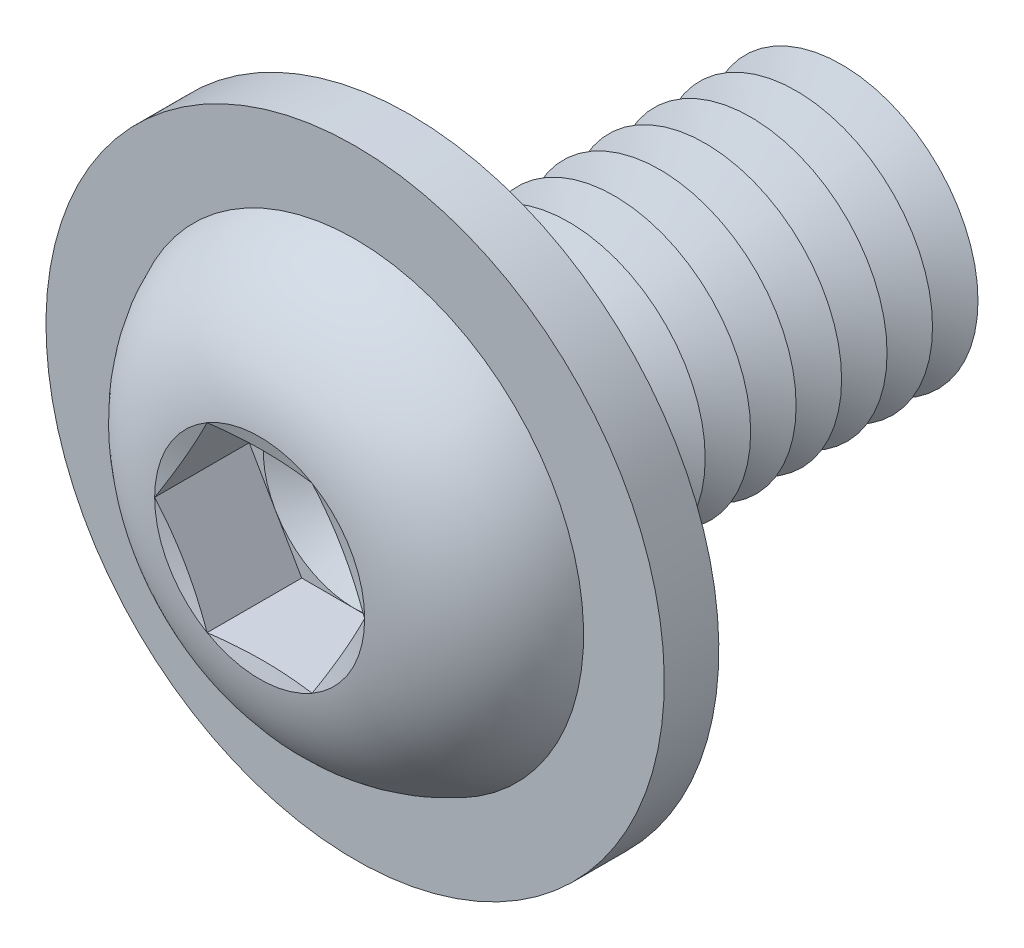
ISO-10303-21;
HEADER;
FILE_DESCRIPTION(('STEP AP214'),'2;1');
FILE_NAME('part.step','',(''),(''),'','','');
FILE_SCHEMA(('AUTOMOTIVE_DESIGN { 1 0 10303 214 1 1 1 1 }'));
ENDSEC;
DATA;
#1=APPLICATION_CONTEXT('core data for automotive mechanical design processes');
#2=APPLICATION_PROTOCOL_DEFINITION('international standard','automotive_design',2000,#1);
#3=PRODUCT_CONTEXT('',#1,'mechanical');
#4=PRODUCT('Part','Part','',(#3));
#5=PRODUCT_RELATED_PRODUCT_CATEGORY('part','',(#4));
#6=PRODUCT_DEFINITION_FORMATION('','',#4);
#7=PRODUCT_DEFINITION_CONTEXT('part definition',#1,'design');
#8=PRODUCT_DEFINITION('design','',#6,#7);
#9=PRODUCT_DEFINITION_SHAPE('','',#8);
#10=(LENGTH_UNIT() NAMED_UNIT(*) SI_UNIT(.MILLI.,.METRE.));
#11=(NAMED_UNIT(*) PLANE_ANGLE_UNIT() SI_UNIT($,.RADIAN.));
#12=(NAMED_UNIT(*) SI_UNIT($,.STERADIAN.) SOLID_ANGLE_UNIT());
#13=UNCERTAINTY_MEASURE_WITH_UNIT(LENGTH_MEASURE(1.E-05),#10,'distance_accuracy_value','');
#14=(GEOMETRIC_REPRESENTATION_CONTEXT(3) GLOBAL_UNCERTAINTY_ASSIGNED_CONTEXT((#13)) GLOBAL_UNIT_ASSIGNED_CONTEXT((#10,
#11,#12)) REPRESENTATION_CONTEXT('',''));
#15=CARTESIAN_POINT('',(0.,0.,0.));
#16=DIRECTION('',(0.,0.,1.));
#17=DIRECTION('',(1.,0.,0.));
#18=AXIS2_PLACEMENT_3D('',#15,#16,#17);
#19=CARTESIAN_POINT('',(0.,0.,-6.5));
#20=DIRECTION('',(0.,0.,1.));
#21=DIRECTION('',(1.,0.,0.));
#22=AXIS2_PLACEMENT_3D('',#19,#20,#21);
#23=CONICAL_SURFACE('',#22,3.,1.0471975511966);
#24=CARTESIAN_POINT('',(0.,0.,-7.));
#25=DIRECTION('',(0.,0.,1.));
#26=DIRECTION('',(1.,0.,0.));
#27=AXIS2_PLACEMENT_3D('',#24,#25,#26);
#28=CIRCLE('',#27,2.13397459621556);
#29=CARTESIAN_POINT('',(2.13397459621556,0.,-7.));
#30=VERTEX_POINT('',#29);
#31=EDGE_CURVE('E290',#30,#30,#28,.T.);
#32=ORIENTED_EDGE('',*,*,#31,.T.);
#33=EDGE_LOOP('',(#32));
#34=FACE_BOUND('',#33,.T.);
#35=CARTESIAN_POINT('',(0.,0.,-6.5));
#36=DIRECTION('',(0.,0.,1.));
#37=DIRECTION('',(1.,0.,0.));
#38=AXIS2_PLACEMENT_3D('',#35,#36,#37);
#39=CIRCLE('',#38,3.);
#40=CARTESIAN_POINT('',(3.,0.,-6.5));
#41=VERTEX_POINT('',#40);
#42=EDGE_CURVE('E286',#41,#41,#39,.T.);
#43=ORIENTED_EDGE('',*,*,#42,.F.);
#44=EDGE_LOOP('',(#43));
#45=FACE_BOUND('',#44,.T.);
#46=ADVANCED_FACE('F39',(#34,#45),#23,.T.);
#47=CARTESIAN_POINT('',(0.,0.,-7.));
#48=DIRECTION('',(0.,0.,-1.));
#49=DIRECTION('',(-1.,0.,0.));
#50=AXIS2_PLACEMENT_3D('',#47,#48,#49);
#51=CONICAL_SURFACE('',#50,2.13397459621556,1.0471975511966);
#52=CARTESIAN_POINT('',(0.,0.,-7.5));
#53=DIRECTION('',(0.,0.,1.));
#54=DIRECTION('',(1.,0.,0.));
#55=AXIS2_PLACEMENT_3D('',#52,#53,#54);
#56=CIRCLE('',#55,3.);
#57=CARTESIAN_POINT('',(3.,0.,-7.5));
#58=VERTEX_POINT('',#57);
#59=EDGE_CURVE('E294',#58,#58,#56,.T.);
#60=ORIENTED_EDGE('',*,*,#59,.T.);
#61=EDGE_LOOP('',(#60));
#62=FACE_BOUND('',#61,.T.);
#63=ORIENTED_EDGE('',*,*,#31,.F.);
#64=EDGE_LOOP('',(#63));
#65=FACE_BOUND('',#64,.T.);
#66=ADVANCED_FACE('F410',(#62,#65),#51,.T.);
#67=CARTESIAN_POINT('',(0.,3.00000000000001,-10.));
#68=DIRECTION('',(0.,0.,-1.));
#69=DIRECTION('',(-1.,0.,0.));
#70=AXIS2_PLACEMENT_3D('',#67,#68,#69);
#71=PLANE('',#70);
#72=CARTESIAN_POINT('',(0.,0.,-10.));
#73=DIRECTION('',(0.,0.,1.));
#74=DIRECTION('',(1.,0.,0.));
#75=AXIS2_PLACEMENT_3D('',#72,#73,#74);
#76=CIRCLE('',#75,2.13397459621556);
#77=CARTESIAN_POINT('',(2.13397459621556,0.,-10.));
#78=VERTEX_POINT('',#77);
#79=EDGE_CURVE('E314',#78,#78,#76,.T.);
#80=ORIENTED_EDGE('',*,*,#79,.F.);
#81=EDGE_LOOP('',(#80));
#82=FACE_BOUND('',#81,.T.);
#83=ADVANCED_FACE('F416',(#82),#71,.T.);
#84=CARTESIAN_POINT('',(0.,0.,-9.5));
#85=DIRECTION('',(0.,0.,1.));
#86=DIRECTION('',(1.,0.,0.));
#87=AXIS2_PLACEMENT_3D('',#84,#85,#86);
#88=CONICAL_SURFACE('',#87,3.,1.0471975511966);
#89=ORIENTED_EDGE('',*,*,#79,.T.);
#90=EDGE_LOOP('',(#89));
#91=FACE_BOUND('',#90,.T.);
#92=CARTESIAN_POINT('',(0.,0.,-9.5));
#93=DIRECTION('',(0.,0.,1.));
#94=DIRECTION('',(1.,0.,0.));
#95=AXIS2_PLACEMENT_3D('',#92,#93,#94);
#96=CIRCLE('',#95,3.);
#97=CARTESIAN_POINT('',(3.,0.,-9.5));
#98=VERTEX_POINT('',#97);
#99=EDGE_CURVE('E310',#98,#98,#96,.T.);
#100=ORIENTED_EDGE('',*,*,#99,.F.);
#101=EDGE_LOOP('',(#100));
#102=FACE_BOUND('',#101,.T.);
#103=ADVANCED_FACE('F435',(#91,#102),#88,.T.);
#104=CARTESIAN_POINT('',(0.,0.,-9.));
#105=DIRECTION('',(0.,0.,-1.));
#106=DIRECTION('',(-1.,0.,0.));
#107=AXIS2_PLACEMENT_3D('',#104,#105,#106);
#108=CONICAL_SURFACE('',#107,2.13397459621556,1.0471975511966);
#109=ORIENTED_EDGE('',*,*,#99,.T.);
#110=EDGE_LOOP('',(#109));
#111=FACE_BOUND('',#110,.T.);
#112=CARTESIAN_POINT('',(0.,0.,-9.));
#113=DIRECTION('',(0.,0.,1.));
#114=DIRECTION('',(1.,0.,0.));
#115=AXIS2_PLACEMENT_3D('',#112,#113,#114);
#116=CIRCLE('',#115,2.13397459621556);
#117=CARTESIAN_POINT('',(2.13397459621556,0.,-9.));
#118=VERTEX_POINT('',#117);
#119=EDGE_CURVE('E306',#118,#118,#116,.T.);
#120=ORIENTED_EDGE('',*,*,#119,.F.);
#121=EDGE_LOOP('',(#120));
#122=FACE_BOUND('',#121,.T.);
#123=ADVANCED_FACE('F432',(#111,#122),#108,.T.);
#124=CARTESIAN_POINT('',(0.,0.,-8.5));
#125=DIRECTION('',(0.,0.,1.));
#126=DIRECTION('',(1.,0.,0.));
#127=AXIS2_PLACEMENT_3D('',#124,#125,#126);
#128=CONICAL_SURFACE('',#127,3.,1.0471975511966);
#129=ORIENTED_EDGE('',*,*,#119,.T.);
#130=EDGE_LOOP('',(#129));
#131=FACE_BOUND('',#130,.T.);
#132=CARTESIAN_POINT('',(0.,0.,-8.5));
#133=DIRECTION('',(0.,0.,1.));
#134=DIRECTION('',(1.,0.,0.));
#135=AXIS2_PLACEMENT_3D('',#132,#133,#134);
#136=CIRCLE('',#135,3.);
#137=CARTESIAN_POINT('',(3.,0.,-8.5));
#138=VERTEX_POINT('',#137);
#139=EDGE_CURVE('E302',#138,#138,#136,.T.);
#140=ORIENTED_EDGE('',*,*,#139,.F.);
#141=EDGE_LOOP('',(#140));
#142=FACE_BOUND('',#141,.T.);
#143=ADVANCED_FACE('F426',(#131,#142),#128,.T.);
#144=CARTESIAN_POINT('',(0.,0.,-8.));
#145=DIRECTION('',(0.,0.,-1.));
#146=DIRECTION('',(-1.,0.,0.));
#147=AXIS2_PLACEMENT_3D('',#144,#145,#146);
#148=CONICAL_SURFACE('',#147,2.13397459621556,1.0471975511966);
#149=ORIENTED_EDGE('',*,*,#139,.T.);
#150=EDGE_LOOP('',(#149));
#151=FACE_BOUND('',#150,.T.);
#152=CARTESIAN_POINT('',(0.,0.,-8.));
#153=DIRECTION('',(0.,0.,1.));
#154=DIRECTION('',(1.,0.,0.));
#155=AXIS2_PLACEMENT_3D('',#152,#153,#154);
#156=CIRCLE('',#155,2.13397459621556);
#157=CARTESIAN_POINT('',(2.13397459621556,0.,-8.));
#158=VERTEX_POINT('',#157);
#159=EDGE_CURVE('E298',#158,#158,#156,.T.);
#160=ORIENTED_EDGE('',*,*,#159,.F.);
#161=EDGE_LOOP('',(#160));
#162=FACE_BOUND('',#161,.T.);
#163=ADVANCED_FACE('F422',(#151,#162),#148,.T.);
#164=CARTESIAN_POINT('',(0.,0.,-7.5));
#165=DIRECTION('',(0.,0.,1.));
#166=DIRECTION('',(1.,0.,0.));
#167=AXIS2_PLACEMENT_3D('',#164,#165,#166);
#168=CONICAL_SURFACE('',#167,3.,1.0471975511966);
#169=ORIENTED_EDGE('',*,*,#159,.T.);
#170=EDGE_LOOP('',(#169));
#171=FACE_BOUND('',#170,.T.);
#172=ORIENTED_EDGE('',*,*,#59,.F.);
#173=EDGE_LOOP('',(#172));
#174=FACE_BOUND('',#173,.T.);
#175=ADVANCED_FACE('F425',(#171,#174),#168,.T.);
#176=CARTESIAN_POINT('',(0.,0.,-5.5));
#177=DIRECTION('',(0.,0.,1.));
#178=DIRECTION('',(1.,0.,0.));
#179=AXIS2_PLACEMENT_3D('',#176,#177,#178);
#180=CONICAL_SURFACE('',#179,3.,1.0471975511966);
#181=CARTESIAN_POINT('',(0.,0.,-6.));
#182=DIRECTION('',(0.,0.,1.));
#183=DIRECTION('',(1.,0.,0.));
#184=AXIS2_PLACEMENT_3D('',#181,#182,#183);
#185=CIRCLE('',#184,2.13397459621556);
#186=CARTESIAN_POINT('',(2.13397459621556,0.,-6.));
#187=VERTEX_POINT('',#186);
#188=EDGE_CURVE('E282',#187,#187,#185,.T.);
#189=ORIENTED_EDGE('',*,*,#188,.T.);
#190=EDGE_LOOP('',(#189));
#191=FACE_BOUND('',#190,.T.);
#192=CARTESIAN_POINT('',(0.,0.,-5.5));
#193=DIRECTION('',(0.,0.,1.));
#194=DIRECTION('',(1.,0.,0.));
#195=AXIS2_PLACEMENT_3D('',#192,#193,#194);
#196=CIRCLE('',#195,3.);
#197=CARTESIAN_POINT('',(3.,0.,-5.5));
#198=VERTEX_POINT('',#197);
#199=EDGE_CURVE('E278',#198,#198,#196,.T.);
#200=ORIENTED_EDGE('',*,*,#199,.F.);
#201=EDGE_LOOP('',(#200));
#202=FACE_BOUND('',#201,.T.);
#203=ADVANCED_FACE('F430',(#191,#202),#180,.T.);
#204=CARTESIAN_POINT('',(0.,0.,-6.));
#205=DIRECTION('',(0.,0.,-1.));
#206=DIRECTION('',(-1.,0.,0.));
#207=AXIS2_PLACEMENT_3D('',#204,#205,#206);
#208=CONICAL_SURFACE('',#207,2.13397459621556,1.0471975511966);
#209=ORIENTED_EDGE('',*,*,#42,.T.);
#210=EDGE_LOOP('',(#209));
#211=FACE_BOUND('',#210,.T.);
#212=ORIENTED_EDGE('',*,*,#188,.F.);
#213=EDGE_LOOP('',(#212));
#214=FACE_BOUND('',#213,.T.);
#215=ADVANCED_FACE('F481',(#211,#214),#208,.T.);
#216=CARTESIAN_POINT('',(0.,0.,-4.5));
#217=DIRECTION('',(0.,0.,1.));
#218=DIRECTION('',(1.,0.,0.));
#219=AXIS2_PLACEMENT_3D('',#216,#217,#218);
#220=CONICAL_SURFACE('',#219,3.,1.0471975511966);
#221=CARTESIAN_POINT('',(0.,0.,-5.));
#222=DIRECTION('',(0.,0.,1.));
#223=DIRECTION('',(1.,0.,0.));
#224=AXIS2_PLACEMENT_3D('',#221,#222,#223);
#225=CIRCLE('',#224,2.13397459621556);
#226=CARTESIAN_POINT('',(2.13397459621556,0.,-5.));
#227=VERTEX_POINT('',#226);
#228=EDGE_CURVE('E274',#227,#227,#225,.T.);
#229=ORIENTED_EDGE('',*,*,#228,.T.);
#230=EDGE_LOOP('',(#229));
#231=FACE_BOUND('',#230,.T.);
#232=CARTESIAN_POINT('',(0.,0.,-4.5));
#233=DIRECTION('',(0.,0.,1.));
#234=DIRECTION('',(1.,0.,0.));
#235=AXIS2_PLACEMENT_3D('',#232,#233,#234);
#236=CIRCLE('',#235,3.);
#237=CARTESIAN_POINT('',(3.,0.,-4.5));
#238=VERTEX_POINT('',#237);
#239=EDGE_CURVE('E270',#238,#238,#236,.T.);
#240=ORIENTED_EDGE('',*,*,#239,.F.);
#241=EDGE_LOOP('',(#240));
#242=FACE_BOUND('',#241,.T.);
#243=ADVANCED_FACE('F487',(#231,#242),#220,.T.);
#244=CARTESIAN_POINT('',(0.,0.,-5.));
#245=DIRECTION('',(0.,0.,-1.));
#246=DIRECTION('',(-1.,0.,0.));
#247=AXIS2_PLACEMENT_3D('',#244,#245,#246);
#248=CONICAL_SURFACE('',#247,2.13397459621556,1.0471975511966);
#249=ORIENTED_EDGE('',*,*,#199,.T.);
#250=EDGE_LOOP('',(#249));
#251=FACE_BOUND('',#250,.T.);
#252=ORIENTED_EDGE('',*,*,#228,.F.);
#253=EDGE_LOOP('',(#252));
#254=FACE_BOUND('',#253,.T.);
#255=ADVANCED_FACE('F494',(#251,#254),#248,.T.);
#256=CARTESIAN_POINT('',(0.,0.,-3.5));
#257=DIRECTION('',(0.,0.,1.));
#258=DIRECTION('',(1.,0.,0.));
#259=AXIS2_PLACEMENT_3D('',#256,#257,#258);
#260=CONICAL_SURFACE('',#259,3.,1.0471975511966);
#261=CARTESIAN_POINT('',(0.,0.,-4.));
#262=DIRECTION('',(0.,0.,1.));
#263=DIRECTION('',(1.,0.,0.));
#264=AXIS2_PLACEMENT_3D('',#261,#262,#263);
#265=CIRCLE('',#264,2.13397459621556);
#266=CARTESIAN_POINT('',(2.13397459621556,0.,-4.));
#267=VERTEX_POINT('',#266);
#268=EDGE_CURVE('E266',#267,#267,#265,.T.);
#269=ORIENTED_EDGE('',*,*,#268,.T.);
#270=EDGE_LOOP('',(#269));
#271=FACE_BOUND('',#270,.T.);
#272=CARTESIAN_POINT('',(0.,0.,-3.5));
#273=DIRECTION('',(0.,0.,1.));
#274=DIRECTION('',(1.,0.,0.));
#275=AXIS2_PLACEMENT_3D('',#272,#273,#274);
#276=CIRCLE('',#275,3.);
#277=CARTESIAN_POINT('',(3.,0.,-3.5));
#278=VERTEX_POINT('',#277);
#279=EDGE_CURVE('E262',#278,#278,#276,.T.);
#280=ORIENTED_EDGE('',*,*,#279,.F.);
#281=EDGE_LOOP('',(#280));
#282=FACE_BOUND('',#281,.T.);
#283=ADVANCED_FACE('F501',(#271,#282),#260,.T.);
#284=CARTESIAN_POINT('',(0.,0.,-4.));
#285=DIRECTION('',(0.,0.,-1.));
#286=DIRECTION('',(-1.,0.,0.));
#287=AXIS2_PLACEMENT_3D('',#284,#285,#286);
#288=CONICAL_SURFACE('',#287,2.13397459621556,1.0471975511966);
#289=ORIENTED_EDGE('',*,*,#239,.T.);
#290=EDGE_LOOP('',(#289));
#291=FACE_BOUND('',#290,.T.);
#292=ORIENTED_EDGE('',*,*,#268,.F.);
#293=EDGE_LOOP('',(#292));
#294=FACE_BOUND('',#293,.T.);
#295=ADVANCED_FACE('F508',(#291,#294),#288,.T.);
#296=CARTESIAN_POINT('',(0.,0.,-2.5));
#297=DIRECTION('',(0.,0.,1.));
#298=DIRECTION('',(1.,0.,0.));
#299=AXIS2_PLACEMENT_3D('',#296,#297,#298);
#300=CONICAL_SURFACE('',#299,3.,1.0471975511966);
#301=CARTESIAN_POINT('',(0.,0.,-3.));
#302=DIRECTION('',(0.,0.,1.));
#303=DIRECTION('',(1.,0.,0.));
#304=AXIS2_PLACEMENT_3D('',#301,#302,#303);
#305=CIRCLE('',#304,2.13397459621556);
#306=CARTESIAN_POINT('',(2.13397459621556,0.,-3.));
#307=VERTEX_POINT('',#306);
#308=EDGE_CURVE('E258',#307,#307,#305,.T.);
#309=ORIENTED_EDGE('',*,*,#308,.T.);
#310=EDGE_LOOP('',(#309));
#311=FACE_BOUND('',#310,.T.);
#312=CARTESIAN_POINT('',(0.,0.,-2.5));
#313=DIRECTION('',(0.,0.,1.));
#314=DIRECTION('',(1.,0.,0.));
#315=AXIS2_PLACEMENT_3D('',#312,#313,#314);
#316=CIRCLE('',#315,3.);
#317=CARTESIAN_POINT('',(3.,0.,-2.5));
#318=VERTEX_POINT('',#317);
#319=EDGE_CURVE('E254',#318,#318,#316,.T.);
#320=ORIENTED_EDGE('',*,*,#319,.F.);
#321=EDGE_LOOP('',(#320));
#322=FACE_BOUND('',#321,.T.);
#323=ADVANCED_FACE('F515',(#311,#322),#300,.T.);
#324=CARTESIAN_POINT('',(0.,0.,-3.));
#325=DIRECTION('',(0.,0.,-1.));
#326=DIRECTION('',(-1.,0.,0.));
#327=AXIS2_PLACEMENT_3D('',#324,#325,#326);
#328=CONICAL_SURFACE('',#327,2.13397459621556,1.0471975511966);
#329=ORIENTED_EDGE('',*,*,#279,.T.);
#330=EDGE_LOOP('',(#329));
#331=FACE_BOUND('',#330,.T.);
#332=ORIENTED_EDGE('',*,*,#308,.F.);
#333=EDGE_LOOP('',(#332));
#334=FACE_BOUND('',#333,.T.);
#335=ADVANCED_FACE('F522',(#331,#334),#328,.T.);
#336=CARTESIAN_POINT('',(0.,0.,-1.5));
#337=DIRECTION('',(0.,0.,1.));
#338=DIRECTION('',(1.,0.,0.));
#339=AXIS2_PLACEMENT_3D('',#336,#337,#338);
#340=CONICAL_SURFACE('',#339,3.,1.0471975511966);
#341=CARTESIAN_POINT('',(0.,0.,-2.));
#342=DIRECTION('',(0.,0.,1.));
#343=DIRECTION('',(1.,0.,0.));
#344=AXIS2_PLACEMENT_3D('',#341,#342,#343);
#345=CIRCLE('',#344,2.13397459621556);
#346=CARTESIAN_POINT('',(2.13397459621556,0.,-2.));
#347=VERTEX_POINT('',#346);
#348=EDGE_CURVE('E250',#347,#347,#345,.T.);
#349=ORIENTED_EDGE('',*,*,#348,.T.);
#350=EDGE_LOOP('',(#349));
#351=FACE_BOUND('',#350,.T.);
#352=CARTESIAN_POINT('',(0.,0.,-1.5));
#353=DIRECTION('',(0.,0.,1.));
#354=DIRECTION('',(1.,0.,0.));
#355=AXIS2_PLACEMENT_3D('',#352,#353,#354);
#356=CIRCLE('',#355,3.);
#357=CARTESIAN_POINT('',(3.,0.,-1.5));
#358=VERTEX_POINT('',#357);
#359=EDGE_CURVE('E242',#358,#358,#356,.T.);
#360=ORIENTED_EDGE('',*,*,#359,.F.);
#361=EDGE_LOOP('',(#360));
#362=FACE_BOUND('',#361,.T.);
#363=ADVANCED_FACE('F529',(#351,#362),#340,.T.);
#364=CARTESIAN_POINT('',(0.,0.,-2.));
#365=DIRECTION('',(0.,0.,-1.));
#366=DIRECTION('',(-1.,0.,0.));
#367=AXIS2_PLACEMENT_3D('',#364,#365,#366);
#368=CONICAL_SURFACE('',#367,2.13397459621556,1.0471975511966);
#369=ORIENTED_EDGE('',*,*,#319,.T.);
#370=EDGE_LOOP('',(#369));
#371=FACE_BOUND('',#370,.T.);
#372=ORIENTED_EDGE('',*,*,#348,.F.);
#373=EDGE_LOOP('',(#372));
#374=FACE_BOUND('',#373,.T.);
#375=ADVANCED_FACE('F536',(#371,#374),#368,.T.);
#376=CARTESIAN_POINT('',(0.,0.,-0.499999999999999));
#377=DIRECTION('',(0.,0.,1.));
#378=DIRECTION('',(1.,0.,0.));
#379=AXIS2_PLACEMENT_3D('',#376,#377,#378);
#380=CONICAL_SURFACE('',#379,3.,1.0471975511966);
#381=CARTESIAN_POINT('',(0.,0.,-0.999999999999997));
#382=DIRECTION('',(0.,0.,1.));
#383=DIRECTION('',(1.,0.,0.));
#384=AXIS2_PLACEMENT_3D('',#381,#382,#383);
#385=CIRCLE('',#384,2.13397459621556);
#386=CARTESIAN_POINT('',(2.13397459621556,0.,-0.999999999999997));
#387=VERTEX_POINT('',#386);
#388=EDGE_CURVE('E231',#387,#387,#385,.T.);
#389=ORIENTED_EDGE('',*,*,#388,.T.);
#390=EDGE_LOOP('',(#389));
#391=FACE_BOUND('',#390,.T.);
#392=CARTESIAN_POINT('',(0.,0.,-0.499999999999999));
#393=DIRECTION('',(0.,0.,1.));
#394=DIRECTION('',(1.,0.,0.));
#395=AXIS2_PLACEMENT_3D('',#392,#393,#394);
#396=CIRCLE('',#395,3.);
#397=CARTESIAN_POINT('',(3.,0.,-0.499999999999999));
#398=VERTEX_POINT('',#397);
#399=EDGE_CURVE('E246',#398,#398,#396,.T.);
#400=ORIENTED_EDGE('',*,*,#399,.F.);
#401=EDGE_LOOP('',(#400));
#402=FACE_BOUND('',#401,.T.);
#403=ADVANCED_FACE('F543',(#391,#402),#380,.T.);
#404=CARTESIAN_POINT('',(0.,0.,-0.999999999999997));
#405=DIRECTION('',(0.,0.,-1.));
#406=DIRECTION('',(-1.,0.,0.));
#407=AXIS2_PLACEMENT_3D('',#404,#405,#406);
#408=CONICAL_SURFACE('',#407,2.13397459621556,1.0471975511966);
#409=ORIENTED_EDGE('',*,*,#359,.T.);
#410=EDGE_LOOP('',(#409));
#411=FACE_BOUND('',#410,.T.);
#412=ORIENTED_EDGE('',*,*,#388,.F.);
#413=EDGE_LOOP('',(#412));
#414=FACE_BOUND('',#413,.T.);
#415=ADVANCED_FACE('F220',(#411,#414),#408,.T.);
#416=CARTESIAN_POINT('',(0.,3.,0.));
#417=DIRECTION('',(0.,0.,-1.));
#418=DIRECTION('',(-1.,0.,0.));
#419=AXIS2_PLACEMENT_3D('',#416,#417,#418);
#420=PLANE('',#419);
#421=CARTESIAN_POINT('',(0.,0.,0.));
#422=DIRECTION('',(0.,0.,-1.));
#423=DIRECTION('',(-1.,0.,0.));
#424=AXIS2_PLACEMENT_3D('',#421,#422,#423);
#425=CIRCLE('',#424,3.5);
#426=CARTESIAN_POINT('',(-3.5,0.,0.));
#427=VERTEX_POINT('',#426);
#428=EDGE_CURVE('E323',#427,#427,#425,.F.);
#429=ORIENTED_EDGE('',*,*,#428,.T.);
#430=EDGE_LOOP('',(#429));
#431=FACE_BOUND('',#430,.T.);
#432=CARTESIAN_POINT('',(0.,0.,0.));
#433=DIRECTION('',(0.,0.,-1.));
#434=DIRECTION('',(0.,1.,0.));
#435=AXIS2_PLACEMENT_3D('',#432,#433,#434);
#436=CIRCLE('',#435,6.8);
#437=CARTESIAN_POINT('',(0.,6.8,0.));
#438=VERTEX_POINT('',#437);
#439=EDGE_CURVE('E388',#438,#438,#436,.T.);
#440=ORIENTED_EDGE('',*,*,#439,.T.);
#441=EDGE_LOOP('',(#440));
#442=FACE_BOUND('',#441,.T.);
#443=ADVANCED_FACE('F397',(#431,#442),#420,.T.);
#444=CARTESIAN_POINT('',(0.,0.,-0.499999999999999));
#445=DIRECTION('',(0.,0.,-1.));
#446=DIRECTION('',(-1.,0.,0.));
#447=AXIS2_PLACEMENT_3D('',#444,#445,#446);
#448=TOROIDAL_SURFACE('',#447,3.5,0.5);
#449=ORIENTED_EDGE('',*,*,#428,.F.);
#450=EDGE_LOOP('',(#449));
#451=FACE_BOUND('',#450,.T.);
#452=ORIENTED_EDGE('',*,*,#399,.T.);
#453=EDGE_LOOP('',(#452));
#454=FACE_BOUND('',#453,.T.);
#455=ADVANCED_FACE('F41',(#451,#454),#448,.F.);
#456=CARTESIAN_POINT('',(0.,0.,1.2));
#457=DIRECTION('',(0.,0.,-1.));
#458=DIRECTION('',(0.,1.,0.));
#459=AXIS2_PLACEMENT_3D('',#456,#457,#458);
#460=CYLINDRICAL_SURFACE('',#459,6.8);
#461=CARTESIAN_POINT('',(0.,0.,1.2));
#462=DIRECTION('',(0.,0.,-1.));
#463=DIRECTION('',(0.,1.,0.));
#464=AXIS2_PLACEMENT_3D('',#461,#462,#463);
#465=CIRCLE('',#464,6.8);
#466=CARTESIAN_POINT('',(0.,6.8,1.2));
#467=VERTEX_POINT('',#466);
#468=EDGE_CURVE('E384',#467,#467,#465,.T.);
#469=ORIENTED_EDGE('',*,*,#468,.T.);
#470=EDGE_LOOP('',(#469));
#471=FACE_BOUND('',#470,.T.);
#472=ORIENTED_EDGE('',*,*,#439,.F.);
#473=EDGE_LOOP('',(#472));
#474=FACE_BOUND('',#473,.T.);
#475=ADVANCED_FACE('F399',(#471,#474),#460,.T.);
#476=CARTESIAN_POINT('',(0.,0.,1.2));
#477=DIRECTION('',(0.,0.,-1.));
#478=DIRECTION('',(0.,1.,0.));
#479=AXIS2_PLACEMENT_3D('',#476,#477,#478);
#480=PLANE('',#479);
#481=CARTESIAN_POINT('',(0.,0.,1.2));
#482=DIRECTION('',(0.,0.,-1.));
#483=DIRECTION('',(0.,1.,0.));
#484=AXIS2_PLACEMENT_3D('',#481,#482,#483);
#485=CIRCLE('',#484,5.02568742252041);
#486=CARTESIAN_POINT('',(0.,5.02568742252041,1.2));
#487=VERTEX_POINT('',#486);
#488=EDGE_CURVE('E43',#487,#487,#485,.F.);
#489=ORIENTED_EDGE('',*,*,#488,.F.);
#490=EDGE_LOOP('',(#489));
#491=FACE_BOUND('',#490,.T.);
#492=ORIENTED_EDGE('',*,*,#468,.F.);
#493=EDGE_LOOP('',(#492));
#494=FACE_BOUND('',#493,.T.);
#495=ADVANCED_FACE('F117',(#491,#494),#480,.F.);
#496=CARTESIAN_POINT('',(0.,0.,1.22));
#497=DIRECTION('',(0.,0.,1.));
#498=DIRECTION('',(1.,0.,0.));
#499=AXIS2_PLACEMENT_3D('',#496,#497,#498);
#500=CONICAL_SURFACE('',#499,1.99999906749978,1.0471975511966);
#501=CARTESIAN_POINT('',(0.,0.,0.0653000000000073));
#502=VERTEX_POINT('',#501);
#503=VERTEX_LOOP('',#502);
#504=FACE_BOUND('',#503,.T.);
#505=CARTESIAN_POINT('',(0.,0.,1.22));
#506=DIRECTION('',(0.,0.,1.));
#507=DIRECTION('',(1.,0.,0.));
#508=AXIS2_PLACEMENT_3D('',#505,#506,#507);
#509=CIRCLE('',#508,1.99999906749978);
#510=CARTESIAN_POINT('',(1.73205,0.999999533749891,1.22));
#511=VERTEX_POINT('',#510);
#512=CARTESIAN_POINT('',(0.,1.99999906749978,1.22));
#513=VERTEX_POINT('',#512);
#514=EDGE_CURVE('E120',#511,#513,#509,.T.);
#515=ORIENTED_EDGE('',*,*,#514,.T.);
#516=CARTESIAN_POINT('',(0.,0.,1.22));
#517=DIRECTION('',(0.,0.,1.));
#518=DIRECTION('',(1.,0.,0.));
#519=AXIS2_PLACEMENT_3D('',#516,#517,#518);
#520=CIRCLE('',#519,1.99999906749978);
#521=CARTESIAN_POINT('',(-1.73205,0.999999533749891,1.22));
#522=VERTEX_POINT('',#521);
#523=EDGE_CURVE('E11',#513,#522,#520,.T.);
#524=ORIENTED_EDGE('',*,*,#523,.T.);
#525=CARTESIAN_POINT('',(-1.73205,-0.999999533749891,1.22));
#526=VERTEX_POINT('',#525);
#527=EDGE_CURVE('E49',#522,#526,#520,.T.);
#528=ORIENTED_EDGE('',*,*,#527,.T.);
#529=CARTESIAN_POINT('',(0.,-1.99999906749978,1.22));
#530=VERTEX_POINT('',#529);
#531=EDGE_CURVE('E329',#526,#530,#520,.T.);
#532=ORIENTED_EDGE('',*,*,#531,.T.);
#533=CARTESIAN_POINT('',(1.73205,-0.999999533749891,1.22));
#534=VERTEX_POINT('',#533);
#535=EDGE_CURVE('E57',#530,#534,#520,.T.);
#536=ORIENTED_EDGE('',*,*,#535,.T.);
#537=EDGE_CURVE('E50',#534,#511,#520,.T.);
#538=ORIENTED_EDGE('',*,*,#537,.T.);
#539=EDGE_LOOP('',(#515,#524,#528,#532,#536,#538));
#540=FACE_BOUND('',#539,.T.);
#541=ADVANCED_FACE('F114',(#504,#540),#500,.F.);
#542=CARTESIAN_POINT('',(0.,0.,1.22));
#543=DIRECTION('',(0.,0.,1.));
#544=DIRECTION('',(1.,0.,0.));
#545=AXIS2_PLACEMENT_3D('',#542,#543,#544);
#546=PLANE('',#545);
#547=ORIENTED_EDGE('',*,*,#531,.F.);
#548=DIRECTION('',(0.5,-0.866025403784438,0.));
#549=VECTOR('',#548,1.);
#550=CARTESIAN_POINT('',(-2.3094,0.,1.22));
#551=LINE('',#550,#549);
#552=CARTESIAN_POINT('',(-1.1547,-1.99999906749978,1.22));
#553=VERTEX_POINT('',#552);
#554=EDGE_CURVE('E153',#526,#553,#551,.T.);
#555=ORIENTED_EDGE('',*,*,#554,.T.);
#556=DIRECTION('',(1.,0.,0.));
#557=VECTOR('',#556,1.);
#558=CARTESIAN_POINT('',(-1.1547,-1.99999906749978,1.22));
#559=LINE('',#558,#557);
#560=EDGE_CURVE('E159',#553,#530,#559,.T.);
#561=ORIENTED_EDGE('',*,*,#560,.T.);
#562=EDGE_LOOP('',(#547,#555,#561));
#563=FACE_BOUND('',#562,.T.);
#564=ADVANCED_FACE('F116',(#563),#546,.T.);
#565=ORIENTED_EDGE('',*,*,#535,.F.);
#566=CARTESIAN_POINT('',(1.1547,-1.99999906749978,1.22));
#567=VERTEX_POINT('',#566);
#568=EDGE_CURVE('E158',#530,#567,#559,.T.);
#569=ORIENTED_EDGE('',*,*,#568,.T.);
#570=DIRECTION('',(0.5,0.866025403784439,0.));
#571=VECTOR('',#570,1.);
#572=CARTESIAN_POINT('',(1.1547,-1.99999906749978,1.22));
#573=LINE('',#572,#571);
#574=EDGE_CURVE('E164',#567,#534,#573,.T.);
#575=ORIENTED_EDGE('',*,*,#574,.T.);
#576=EDGE_LOOP('',(#565,#569,#575));
#577=FACE_BOUND('',#576,.T.);
#578=ADVANCED_FACE('F585',(#577),#546,.T.);
#579=ORIENTED_EDGE('',*,*,#537,.F.);
#580=CARTESIAN_POINT('',(2.3094,0.,1.22));
#581=VERTEX_POINT('',#580);
#582=EDGE_CURVE('E163',#534,#581,#573,.T.);
#583=ORIENTED_EDGE('',*,*,#582,.T.);
#584=DIRECTION('',(-0.5,0.866025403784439,0.));
#585=VECTOR('',#584,1.);
#586=CARTESIAN_POINT('',(2.3094,0.,1.22));
#587=LINE('',#586,#585);
#588=EDGE_CURVE('E142',#581,#511,#587,.T.);
#589=ORIENTED_EDGE('',*,*,#588,.T.);
#590=EDGE_LOOP('',(#579,#583,#589));
#591=FACE_BOUND('',#590,.T.);
#592=ADVANCED_FACE('F594',(#591),#546,.T.);
#593=ORIENTED_EDGE('',*,*,#514,.F.);
#594=CARTESIAN_POINT('',(1.1547,1.99999906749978,1.22));
#595=VERTEX_POINT('',#594);
#596=EDGE_CURVE('E127',#511,#595,#587,.T.);
#597=ORIENTED_EDGE('',*,*,#596,.T.);
#598=DIRECTION('',(-1.,0.,0.));
#599=VECTOR('',#598,1.);
#600=CARTESIAN_POINT('',(1.1547,1.99999906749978,1.22));
#601=LINE('',#600,#599);
#602=EDGE_CURVE('E138',#595,#513,#601,.T.);
#603=ORIENTED_EDGE('',*,*,#602,.T.);
#604=EDGE_LOOP('',(#593,#597,#603));
#605=FACE_BOUND('',#604,.T.);
#606=ADVANCED_FACE('F144',(#605),#546,.T.);
#607=ORIENTED_EDGE('',*,*,#523,.F.);
#608=CARTESIAN_POINT('',(-1.1547,1.99999906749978,1.22));
#609=VERTEX_POINT('',#608);
#610=EDGE_CURVE('E133',#513,#609,#601,.T.);
#611=ORIENTED_EDGE('',*,*,#610,.T.);
#612=DIRECTION('',(-0.5,-0.866025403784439,0.));
#613=VECTOR('',#612,1.);
#614=CARTESIAN_POINT('',(-1.1547,1.99999906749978,1.22));
#615=LINE('',#614,#613);
#616=EDGE_CURVE('E136',#609,#522,#615,.T.);
#617=ORIENTED_EDGE('',*,*,#616,.T.);
#618=EDGE_LOOP('',(#607,#611,#617));
#619=FACE_BOUND('',#618,.T.);
#620=ADVANCED_FACE('F132',(#619),#546,.T.);
#621=ORIENTED_EDGE('',*,*,#527,.F.);
#622=CARTESIAN_POINT('',(-2.3094,0.,1.22));
#623=VERTEX_POINT('',#622);
#624=EDGE_CURVE('E146',#522,#623,#615,.T.);
#625=ORIENTED_EDGE('',*,*,#624,.T.);
#626=EDGE_CURVE('E154',#623,#526,#551,.T.);
#627=ORIENTED_EDGE('',*,*,#626,.T.);
#628=EDGE_LOOP('',(#621,#625,#627));
#629=FACE_BOUND('',#628,.T.);
#630=ADVANCED_FACE('F343',(#629),#546,.T.);
#631=CARTESIAN_POINT('',(-2.3094,0.,1.22));
#632=DIRECTION('',(-0.866025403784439,-0.5,0.));
#633=DIRECTION('',(0.5,-0.866025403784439,0.));
#634=AXIS2_PLACEMENT_3D('',#631,#632,#633);
#635=PLANE('',#634);
#636=CARTESIAN_POINT('',(-2.30951547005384,0.000200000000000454,3.30003094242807));
#637=CARTESIAN_POINT('',(-2.26155412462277,-0.082871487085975,3.2871729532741));
#638=CARTESIAN_POINT('',(-2.21350580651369,-0.166093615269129,3.27549992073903));
#639=CARTESIAN_POINT('',(-2.11723944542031,-0.332831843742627,3.2549913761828));
#640=CARTESIAN_POINT('',(-2.06902134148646,-0.416348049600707,3.24615701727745));
#641=CARTESIAN_POINT('',(-1.97270782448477,-0.583167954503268,3.23184167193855));
#642=CARTESIAN_POINT('',(-1.92461306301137,-0.666470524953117,3.22634360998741));
#643=CARTESIAN_POINT('',(-1.82836219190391,-0.83318192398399,3.21897125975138));
#644=CARTESIAN_POINT('',(-1.78020609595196,-0.916590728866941,3.21709626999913));
#645=CARTESIAN_POINT('',(-1.68389390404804,-1.08340833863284,3.21709626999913));
#646=CARTESIAN_POINT('',(-1.63573780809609,-1.16681714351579,3.21897125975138));
#647=CARTESIAN_POINT('',(-1.53948693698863,-1.33352854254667,3.22634360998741));
#648=CARTESIAN_POINT('',(-1.49139217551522,-1.41683111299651,3.23184167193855));
#649=CARTESIAN_POINT('',(-1.39507865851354,-1.58365101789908,3.24615701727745));
#650=CARTESIAN_POINT('',(-1.34686055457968,-1.66716722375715,3.2549913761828));
#651=CARTESIAN_POINT('',(-1.25059419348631,-1.83390545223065,3.27549992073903));
#652=CARTESIAN_POINT('',(-1.20254587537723,-1.91712758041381,3.2871729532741));
#653=CARTESIAN_POINT('',(-1.15458452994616,-2.00019906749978,3.30003094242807));
#654=B_SPLINE_CURVE_WITH_KNOTS('',3,(#636,#637,#638,#639,#640,#641,#642,#643,#644,#645,#646,
#647,#648,#649,#650,#651,#652,#653),.UNSPECIFIED.,.F.,.F.,(4,2,2,2,2,2,2,2,4),(0.,
0.290357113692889,0.580832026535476,0.869807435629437,1.15872689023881,1.44764634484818,
1.73662175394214,2.02709666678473,2.31745378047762),.UNSPECIFIED.);
#655=CARTESIAN_POINT('',(-2.3094,0.,3.3));
#656=VERTEX_POINT('',#655);
#657=CARTESIAN_POINT('',(-1.1547,-1.99999906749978,3.3));
#658=VERTEX_POINT('',#657);
#659=EDGE_CURVE('E348',#656,#658,#654,.T.);
#660=ORIENTED_EDGE('',*,*,#659,.T.);
#661=DIRECTION('',(0.,0.,1.));
#662=VECTOR('',#661,1.);
#663=CARTESIAN_POINT('',(-1.1547,-1.99999906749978,1.22));
#664=LINE('',#663,#662);
#665=EDGE_CURVE('E177',#553,#658,#664,.T.);
#666=ORIENTED_EDGE('',*,*,#665,.F.);
#667=ORIENTED_EDGE('',*,*,#554,.F.);
#668=ORIENTED_EDGE('',*,*,#626,.F.);
#669=DIRECTION('',(0.,0.,1.));
#670=VECTOR('',#669,1.);
#671=CARTESIAN_POINT('',(-2.3094,0.,1.22));
#672=LINE('',#671,#670);
#673=EDGE_CURVE('E181',#623,#656,#672,.T.);
#674=ORIENTED_EDGE('',*,*,#673,.T.);
#675=EDGE_LOOP('',(#660,#666,#667,#668,#674));
#676=FACE_BOUND('',#675,.T.);
#677=ADVANCED_FACE('F341',(#676),#635,.F.);
#678=CARTESIAN_POINT('',(-1.1547,-1.99999906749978,1.22));
#679=DIRECTION('',(0.,-1.,0.));
#680=DIRECTION('',(0.,0.,-1.));
#681=AXIS2_PLACEMENT_3D('',#678,#679,#680);
#682=PLANE('',#681);
#683=CARTESIAN_POINT('',(-3.4849337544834,-1.99999906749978,3.75783251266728));
#684=CARTESIAN_POINT('',(-3.40057136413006,-1.99999906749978,3.7382285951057));
#685=CARTESIAN_POINT('',(-3.31617090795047,-1.99999906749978,3.71878852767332));
#686=CARTESIAN_POINT('',(-3.14727791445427,-1.99999906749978,3.68030638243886));
#687=CARTESIAN_POINT('',(-3.06278537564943,-1.99999906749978,3.6612643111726));
#688=CARTESIAN_POINT('',(-2.80911712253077,-1.99999906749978,3.604834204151));
#689=CARTESIAN_POINT('',(-2.63978343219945,-1.99999906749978,3.5681499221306));
#690=CARTESIAN_POINT('',(-2.29895421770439,-1.99999906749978,3.49717072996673));
#691=CARTESIAN_POINT('',(-2.12745330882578,-1.99999906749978,3.4629014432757));
#692=CARTESIAN_POINT('',(-1.78364663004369,-1.99999906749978,3.39849485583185));
#693=CARTESIAN_POINT('',(-1.61134079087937,-1.99999906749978,3.36835791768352));
#694=CARTESIAN_POINT('',(-1.27040784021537,-1.99999906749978,3.31501553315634));
#695=CARTESIAN_POINT('',(-1.10180724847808,-1.99999906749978,3.29164468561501));
#696=CARTESIAN_POINT('',(-0.76364137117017,-1.99999906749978,3.2533727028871));
#697=CARTESIAN_POINT('',(-0.594076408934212,-1.99999906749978,3.23846888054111));
#698=CARTESIAN_POINT('',(-0.339649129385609,-1.99999906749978,3.22431372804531));
#699=CARTESIAN_POINT('',(-0.255009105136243,-1.99999906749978,3.22096057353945));
#700=CARTESIAN_POINT('',(-0.0856618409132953,-1.99999906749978,3.21711210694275));
#701=CARTESIAN_POINT('',(-0.000954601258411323,-1.99999906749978,3.21661678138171));
#702=CARTESIAN_POINT('',(0.168430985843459,-1.99999906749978,3.21851478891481));
#703=CARTESIAN_POINT('',(0.253109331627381,-1.99999906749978,3.22090826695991));
#704=CARTESIAN_POINT('',(0.422344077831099,-1.99999906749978,3.22845792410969));
#705=CARTESIAN_POINT('',(0.506900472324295,-1.99999906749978,3.23361423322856));
#706=CARTESIAN_POINT('',(0.712240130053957,-1.99999906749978,3.24921577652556));
#707=CARTESIAN_POINT('',(0.832922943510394,-1.99999906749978,3.26098285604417));
#708=CARTESIAN_POINT('',(1.07378161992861,-1.99999906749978,3.28874908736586));
#709=CARTESIAN_POINT('',(1.1939575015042,-1.99999906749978,3.30474808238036));
#710=CARTESIAN_POINT('',(1.43419655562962,-1.99999906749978,3.34009172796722));
#711=CARTESIAN_POINT('',(1.55425817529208,-1.99999906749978,3.35944677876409));
#712=CARTESIAN_POINT('',(1.79394991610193,-1.99999906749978,3.40067076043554));
#713=CARTESIAN_POINT('',(1.91358001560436,-1.99999906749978,3.42253981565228));
#714=CARTESIAN_POINT('',(2.15493405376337,-1.99999906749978,3.46864194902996));
#715=CARTESIAN_POINT('',(2.27665041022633,-1.99999906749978,3.49291441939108));
#716=CARTESIAN_POINT('',(2.51977680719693,-1.99999906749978,3.54294628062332));
#717=CARTESIAN_POINT('',(2.64118684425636,-1.99999906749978,3.56870568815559));
#718=CARTESIAN_POINT('',(2.88310060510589,-1.99999906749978,3.6212089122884));
#719=CARTESIAN_POINT('',(3.00360566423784,-1.99999906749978,3.64794660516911));
#720=CARTESIAN_POINT('',(3.24441021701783,-1.99999906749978,3.70229477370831));
#721=CARTESIAN_POINT('',(3.36470972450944,-1.99999906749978,3.7299051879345));
#722=CARTESIAN_POINT('',(3.4849337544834,-1.99999906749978,3.75783251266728));
#723=B_SPLINE_CURVE_WITH_KNOTS('',3,(#683,#684,#685,#686,#687,#688,#689,#690,#691,#692,#693,
#694,#695,#696,#697,#698,#699,#700,#701,#702,#703,#704,#705,#706,#707,#708,#709,#710,#711,#712,
#713,#714,#715,#716,#717,#718,#719,#720,#721,#722),.UNSPECIFIED.,.F.,.F.,(4,2,2,2,2,2,2,2,2,2,2,
2,2,2,2,2,2,2,2,4),(0.,0.259830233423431,0.519664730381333,1.03943435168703,1.56407662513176,
2.08876490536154,2.59926476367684,3.10960251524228,3.36367930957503,3.61775490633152,
3.87184325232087,4.1259435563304,4.48960924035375,4.85326145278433,5.21806142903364,
5.58287945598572,5.95520617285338,6.32753706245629,6.69784064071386,7.06811821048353),.UNSPECIFIED.);
#724=CARTESIAN_POINT('',(1.1547,-1.99999906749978,3.3));
#725=VERTEX_POINT('',#724);
#726=EDGE_CURVE('E355',#658,#725,#723,.T.);
#727=ORIENTED_EDGE('',*,*,#726,.T.);
#728=DIRECTION('',(0.,0.,1.));
#729=VECTOR('',#728,1.);
#730=CARTESIAN_POINT('',(1.1547,-1.99999906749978,1.22));
#731=LINE('',#730,#729);
#732=EDGE_CURVE('E173',#567,#725,#731,.T.);
#733=ORIENTED_EDGE('',*,*,#732,.F.);
#734=ORIENTED_EDGE('',*,*,#568,.F.);
#735=ORIENTED_EDGE('',*,*,#560,.F.);
#736=ORIENTED_EDGE('',*,*,#665,.T.);
#737=EDGE_LOOP('',(#727,#733,#734,#735,#736));
#738=FACE_BOUND('',#737,.T.);
#739=ADVANCED_FACE('F628',(#738),#682,.F.);
#740=CARTESIAN_POINT('',(1.1547,-1.99999906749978,1.22));
#741=DIRECTION('',(0.866025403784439,-0.5,0.));
#742=DIRECTION('',(0.5,0.866025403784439,0.));
#743=AXIS2_PLACEMENT_3D('',#740,#741,#742);
#744=PLANE('',#743);
#745=CARTESIAN_POINT('',(1.15458452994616,-2.00019906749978,3.30003094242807));
#746=CARTESIAN_POINT('',(1.20254587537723,-1.91712758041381,3.2871729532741));
#747=CARTESIAN_POINT('',(1.25059419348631,-1.83390545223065,3.27549992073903));
#748=CARTESIAN_POINT('',(1.34686055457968,-1.66716722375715,3.2549913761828));
#749=CARTESIAN_POINT('',(1.39507865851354,-1.58365101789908,3.24615701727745));
#750=CARTESIAN_POINT('',(1.49139217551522,-1.41683111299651,3.23184167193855));
#751=CARTESIAN_POINT('',(1.53948693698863,-1.33352854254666,3.22634360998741));
#752=CARTESIAN_POINT('',(1.63573780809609,-1.16681714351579,3.21897125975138));
#753=CARTESIAN_POINT('',(1.68389390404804,-1.08340833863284,3.21709626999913));
#754=CARTESIAN_POINT('',(1.78020609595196,-0.91659072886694,3.21709626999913));
#755=CARTESIAN_POINT('',(1.82836219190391,-0.83318192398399,3.21897125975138));
#756=CARTESIAN_POINT('',(1.92461306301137,-0.666470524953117,3.22634360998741));
#757=CARTESIAN_POINT('',(1.97270782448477,-0.583167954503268,3.23184167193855));
#758=CARTESIAN_POINT('',(2.06902134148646,-0.416348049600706,3.24615701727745));
#759=CARTESIAN_POINT('',(2.11723944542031,-0.332831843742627,3.2549913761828));
#760=CARTESIAN_POINT('',(2.21350580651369,-0.166093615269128,3.27549992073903));
#761=CARTESIAN_POINT('',(2.26155412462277,-0.0828714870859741,3.2871729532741));
#762=CARTESIAN_POINT('',(2.30951547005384,0.000200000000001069,3.30003094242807));
#763=B_SPLINE_CURVE_WITH_KNOTS('',3,(#745,#746,#747,#748,#749,#750,#751,#752,#753,#754,#755,
#756,#757,#758,#759,#760,#761,#762),.UNSPECIFIED.,.F.,.F.,(4,2,2,2,2,2,2,2,4),(0.,
0.290357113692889,0.580832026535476,0.869807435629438,1.15872689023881,1.44764634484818,
1.73662175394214,2.02709666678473,2.31745378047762),.UNSPECIFIED.);
#764=CARTESIAN_POINT('',(2.3094,0.,3.3));
#765=VERTEX_POINT('',#764);
#766=EDGE_CURVE('E232',#725,#765,#763,.T.);
#767=ORIENTED_EDGE('',*,*,#766,.T.);
#768=DIRECTION('',(0.,0.,1.));
#769=VECTOR('',#768,1.);
#770=CARTESIAN_POINT('',(2.3094,0.,1.22));
#771=LINE('',#770,#769);
#772=EDGE_CURVE('E168',#581,#765,#771,.T.);
#773=ORIENTED_EDGE('',*,*,#772,.F.);
#774=ORIENTED_EDGE('',*,*,#582,.F.);
#775=ORIENTED_EDGE('',*,*,#574,.F.);
#776=ORIENTED_EDGE('',*,*,#732,.T.);
#777=EDGE_LOOP('',(#767,#773,#774,#775,#776));
#778=FACE_BOUND('',#777,.T.);
#779=ADVANCED_FACE('F218',(#778),#744,.F.);
#780=CARTESIAN_POINT('',(2.3094,0.,1.22));
#781=DIRECTION('',(0.866025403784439,0.5,0.));
#782=DIRECTION('',(-0.5,0.866025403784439,0.));
#783=AXIS2_PLACEMENT_3D('',#780,#781,#782);
#784=PLANE('',#783);
#785=CARTESIAN_POINT('',(2.30951547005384,-0.000199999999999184,3.30003094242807));
#786=CARTESIAN_POINT('',(2.26155412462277,0.082871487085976,3.2871729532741));
#787=CARTESIAN_POINT('',(2.21350580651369,0.16609361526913,3.27549992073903));
#788=CARTESIAN_POINT('',(2.11723944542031,0.332831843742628,3.2549913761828));
#789=CARTESIAN_POINT('',(2.06902134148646,0.416348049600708,3.24615701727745));
#790=CARTESIAN_POINT('',(1.97270782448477,0.583167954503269,3.23184167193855));
#791=CARTESIAN_POINT('',(1.92461306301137,0.666470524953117,3.22634360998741));
#792=CARTESIAN_POINT('',(1.82836219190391,0.833181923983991,3.21897125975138));
#793=CARTESIAN_POINT('',(1.78020609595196,0.916590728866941,3.21709626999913));
#794=CARTESIAN_POINT('',(1.68389390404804,1.08340833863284,3.21709626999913));
#795=CARTESIAN_POINT('',(1.63573780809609,1.16681714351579,3.21897125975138));
#796=CARTESIAN_POINT('',(1.53948693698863,1.33352854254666,3.22634360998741));
#797=CARTESIAN_POINT('',(1.49139217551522,1.41683111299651,3.23184167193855));
#798=CARTESIAN_POINT('',(1.39507865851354,1.58365101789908,3.24615701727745));
#799=CARTESIAN_POINT('',(1.34686055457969,1.66716722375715,3.2549913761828));
#800=CARTESIAN_POINT('',(1.25059419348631,1.83390545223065,3.27549992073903));
#801=CARTESIAN_POINT('',(1.20254587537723,1.91712758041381,3.2871729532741));
#802=CARTESIAN_POINT('',(1.15458452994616,2.00019906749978,3.30003094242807));
#803=B_SPLINE_CURVE_WITH_KNOTS('',3,(#785,#786,#787,#788,#789,#790,#791,#792,#793,#794,#795,
#796,#797,#798,#799,#800,#801,#802),.UNSPECIFIED.,.F.,.F.,(4,2,2,2,2,2,2,2,4),(0.,
0.290357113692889,0.580832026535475,0.869807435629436,1.15872689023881,1.44764634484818,
1.73662175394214,2.02709666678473,2.31745378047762),.UNSPECIFIED.);
#804=CARTESIAN_POINT('',(1.1547,1.99999906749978,3.3));
#805=VERTEX_POINT('',#804);
#806=EDGE_CURVE('E223',#765,#805,#803,.T.);
#807=ORIENTED_EDGE('',*,*,#806,.T.);
#808=DIRECTION('',(0.,0.,1.));
#809=VECTOR('',#808,1.);
#810=CARTESIAN_POINT('',(1.1547,1.99999906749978,1.22));
#811=LINE('',#810,#809);
#812=EDGE_CURVE('E65',#595,#805,#811,.T.);
#813=ORIENTED_EDGE('',*,*,#812,.F.);
#814=ORIENTED_EDGE('',*,*,#596,.F.);
#815=ORIENTED_EDGE('',*,*,#588,.F.);
#816=ORIENTED_EDGE('',*,*,#772,.T.);
#817=EDGE_LOOP('',(#807,#813,#814,#815,#816));
#818=FACE_BOUND('',#817,.T.);
#819=ADVANCED_FACE('F212',(#818),#784,.F.);
#820=CARTESIAN_POINT('',(1.1547,1.99999906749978,1.22));
#821=DIRECTION('',(0.,1.,0.));
#822=DIRECTION('',(-1.,0.,0.));
#823=AXIS2_PLACEMENT_3D('',#820,#821,#822);
#824=PLANE('',#823);
#825=CARTESIAN_POINT('',(3.4849337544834,1.99999906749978,3.75783251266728));
#826=CARTESIAN_POINT('',(3.40057136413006,1.99999906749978,3.7382285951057));
#827=CARTESIAN_POINT('',(3.31617090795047,1.99999906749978,3.71878852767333));
#828=CARTESIAN_POINT('',(3.14727791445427,1.99999906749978,3.68030638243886));
#829=CARTESIAN_POINT('',(3.06278537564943,1.99999906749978,3.6612643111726));
#830=CARTESIAN_POINT('',(2.80911712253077,1.99999906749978,3.604834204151));
#831=CARTESIAN_POINT('',(2.63978343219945,1.99999906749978,3.5681499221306));
#832=CARTESIAN_POINT('',(2.29895421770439,1.99999906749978,3.49717072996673));
#833=CARTESIAN_POINT('',(2.12745330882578,1.99999906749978,3.4629014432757));
#834=CARTESIAN_POINT('',(1.78364663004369,1.99999906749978,3.39849485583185));
#835=CARTESIAN_POINT('',(1.61134079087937,1.99999906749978,3.36835791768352));
#836=CARTESIAN_POINT('',(1.27040784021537,1.99999906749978,3.31501553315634));
#837=CARTESIAN_POINT('',(1.10180724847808,1.99999906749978,3.29164468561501));
#838=CARTESIAN_POINT('',(0.763641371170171,1.99999906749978,3.2533727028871));
#839=CARTESIAN_POINT('',(0.594076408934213,1.99999906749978,3.23846888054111));
#840=CARTESIAN_POINT('',(0.339649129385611,1.99999906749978,3.22431372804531));
#841=CARTESIAN_POINT('',(0.255009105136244,1.99999906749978,3.22096057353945));
#842=CARTESIAN_POINT('',(0.0856618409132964,1.99999906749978,3.21711210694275));
#843=CARTESIAN_POINT('',(0.000954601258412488,1.99999906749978,3.21661678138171));
#844=CARTESIAN_POINT('',(-0.168430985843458,1.99999906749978,3.21851478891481));
#845=CARTESIAN_POINT('',(-0.25310933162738,1.99999906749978,3.22090826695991));
#846=CARTESIAN_POINT('',(-0.422344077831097,1.99999906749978,3.22845792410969));
#847=CARTESIAN_POINT('',(-0.506900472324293,1.99999906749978,3.23361423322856));
#848=CARTESIAN_POINT('',(-0.712240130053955,1.99999906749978,3.24921577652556));
#849=CARTESIAN_POINT('',(-0.832922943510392,1.99999906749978,3.26098285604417));
#850=CARTESIAN_POINT('',(-1.07378161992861,1.99999906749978,3.28874908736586));
#851=CARTESIAN_POINT('',(-1.1939575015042,1.99999906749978,3.30474808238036));
#852=CARTESIAN_POINT('',(-1.43419655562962,1.99999906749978,3.34009172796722));
#853=CARTESIAN_POINT('',(-1.55425817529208,1.99999906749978,3.35944677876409));
#854=CARTESIAN_POINT('',(-1.79394991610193,1.99999906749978,3.40067076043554));
#855=CARTESIAN_POINT('',(-1.91358001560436,1.99999906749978,3.42253981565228));
#856=CARTESIAN_POINT('',(-2.15493405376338,1.99999906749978,3.46864194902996));
#857=CARTESIAN_POINT('',(-2.27665041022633,1.99999906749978,3.49291441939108));
#858=CARTESIAN_POINT('',(-2.51977680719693,1.99999906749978,3.54294628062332));
#859=CARTESIAN_POINT('',(-2.64118684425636,1.99999906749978,3.56870568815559));
#860=CARTESIAN_POINT('',(-2.8831006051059,1.99999906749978,3.6212089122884));
#861=CARTESIAN_POINT('',(-3.00360566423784,1.99999906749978,3.64794660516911));
#862=CARTESIAN_POINT('',(-3.24441021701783,1.99999906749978,3.70229477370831));
#863=CARTESIAN_POINT('',(-3.36470972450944,1.99999906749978,3.7299051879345));
#864=CARTESIAN_POINT('',(-3.4849337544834,1.99999906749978,3.75783251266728));
#865=B_SPLINE_CURVE_WITH_KNOTS('',3,(#825,#826,#827,#828,#829,#830,#831,#832,#833,#834,#835,
#836,#837,#838,#839,#840,#841,#842,#843,#844,#845,#846,#847,#848,#849,#850,#851,#852,#853,#854,
#855,#856,#857,#858,#859,#860,#861,#862,#863,#864),.UNSPECIFIED.,.F.,.F.,(4,2,2,2,2,2,2,2,2,2,2,
2,2,2,2,2,2,2,2,4),(0.,0.259830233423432,0.519664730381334,1.03943435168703,1.56407662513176,
2.08876490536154,2.59926476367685,3.10960251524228,3.36367930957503,3.61775490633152,
3.87184325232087,4.1259435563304,4.48960924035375,4.85326145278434,5.21806142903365,
5.58287945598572,5.95520617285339,6.3275370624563,6.69784064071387,7.06811821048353),.UNSPECIFIED.);
#866=CARTESIAN_POINT('',(-1.1547,1.99999906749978,3.3));
#867=VERTEX_POINT('',#866);
#868=EDGE_CURVE('E172',#805,#867,#865,.T.);
#869=ORIENTED_EDGE('',*,*,#868,.T.);
#870=DIRECTION('',(0.,0.,1.));
#871=VECTOR('',#870,1.);
#872=CARTESIAN_POINT('',(-1.1547,1.99999906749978,1.22));
#873=LINE('',#872,#871);
#874=EDGE_CURVE('E140',#609,#867,#873,.T.);
#875=ORIENTED_EDGE('',*,*,#874,.F.);
#876=ORIENTED_EDGE('',*,*,#610,.F.);
#877=ORIENTED_EDGE('',*,*,#602,.F.);
#878=ORIENTED_EDGE('',*,*,#812,.T.);
#879=EDGE_LOOP('',(#869,#875,#876,#877,#878));
#880=FACE_BOUND('',#879,.T.);
#881=ADVANCED_FACE('F137',(#880),#824,.F.);
#882=CARTESIAN_POINT('',(-1.1547,1.99999906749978,1.22));
#883=DIRECTION('',(-0.866025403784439,0.5,0.));
#884=DIRECTION('',(-0.5,-0.866025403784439,0.));
#885=AXIS2_PLACEMENT_3D('',#882,#883,#884);
#886=PLANE('',#885);
#887=CARTESIAN_POINT('',(-1.15458452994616,2.00019906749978,3.30003094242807));
#888=CARTESIAN_POINT('',(-1.20254587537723,1.91712758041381,3.2871729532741));
#889=CARTESIAN_POINT('',(-1.25059419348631,1.83390545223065,3.27549992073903));
#890=CARTESIAN_POINT('',(-1.34686055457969,1.66716722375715,3.2549913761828));
#891=CARTESIAN_POINT('',(-1.39507865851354,1.58365101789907,3.24615701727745));
#892=CARTESIAN_POINT('',(-1.49139217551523,1.41683111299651,3.23184167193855));
#893=CARTESIAN_POINT('',(-1.53948693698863,1.33352854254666,3.22634360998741));
#894=CARTESIAN_POINT('',(-1.63573780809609,1.16681714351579,3.21897125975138));
#895=CARTESIAN_POINT('',(-1.68389390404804,1.08340833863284,3.21709626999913));
#896=CARTESIAN_POINT('',(-1.78020609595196,0.916590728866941,3.21709626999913));
#897=CARTESIAN_POINT('',(-1.82836219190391,0.83318192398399,3.21897125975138));
#898=CARTESIAN_POINT('',(-1.92461306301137,0.666470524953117,3.22634360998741));
#899=CARTESIAN_POINT('',(-1.97270782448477,0.583167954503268,3.23184167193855));
#900=CARTESIAN_POINT('',(-2.06902134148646,0.416348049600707,3.24615701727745));
#901=CARTESIAN_POINT('',(-2.11723944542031,0.332831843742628,3.2549913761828));
#902=CARTESIAN_POINT('',(-2.21350580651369,0.16609361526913,3.27549992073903));
#903=CARTESIAN_POINT('',(-2.26155412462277,0.0828714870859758,3.2871729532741));
#904=CARTESIAN_POINT('',(-2.30951547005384,-0.000199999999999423,3.30003094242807));
#905=B_SPLINE_CURVE_WITH_KNOTS('',3,(#887,#888,#889,#890,#891,#892,#893,#894,#895,#896,#897,
#898,#899,#900,#901,#902,#903,#904),.UNSPECIFIED.,.F.,.F.,(4,2,2,2,2,2,2,2,4),(0.,
0.290357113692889,0.580832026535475,0.869807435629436,1.15872689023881,1.44764634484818,
1.73662175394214,2.02709666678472,2.31745378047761),.UNSPECIFIED.);
#906=EDGE_CURVE('E197',#867,#656,#905,.T.);
#907=ORIENTED_EDGE('',*,*,#906,.T.);
#908=ORIENTED_EDGE('',*,*,#673,.F.);
#909=ORIENTED_EDGE('',*,*,#624,.F.);
#910=ORIENTED_EDGE('',*,*,#616,.F.);
#911=ORIENTED_EDGE('',*,*,#874,.T.);
#912=EDGE_LOOP('',(#907,#908,#909,#910,#911));
#913=FACE_BOUND('',#912,.T.);
#914=ADVANCED_FACE('F211',(#913),#886,.F.);
#915=CARTESIAN_POINT('',(0.,0.,3.3));
#916=DIRECTION('',(0.,0.,1.));
#917=DIRECTION('',(1.,0.,0.));
#918=AXIS2_PLACEMENT_3D('',#915,#916,#917);
#919=CONICAL_SURFACE('',#918,2.3094,1.30899693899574);
#920=ORIENTED_EDGE('',*,*,#659,.F.);
#921=CARTESIAN_POINT('',(0.,0.,3.3));
#922=DIRECTION('',(0.,0.,-1.));
#923=DIRECTION('',(-1.,0.,0.));
#924=AXIS2_PLACEMENT_3D('',#921,#922,#923);
#925=CIRCLE('',#924,2.3094);
#926=EDGE_CURVE('E318',#658,#656,#925,.T.);
#927=ORIENTED_EDGE('',*,*,#926,.F.);
#928=EDGE_LOOP('',(#920,#927));
#929=FACE_BOUND('',#928,.T.);
#930=ADVANCED_FACE('F352',(#929),#919,.F.);
#931=ORIENTED_EDGE('',*,*,#726,.F.);
#932=EDGE_CURVE('E363',#725,#658,#925,.T.);
#933=ORIENTED_EDGE('',*,*,#932,.F.);
#934=EDGE_LOOP('',(#931,#933));
#935=FACE_BOUND('',#934,.T.);
#936=ADVANCED_FACE('F664',(#935),#919,.F.);
#937=ORIENTED_EDGE('',*,*,#766,.F.);
#938=EDGE_CURVE('E375',#765,#725,#925,.T.);
#939=ORIENTED_EDGE('',*,*,#938,.F.);
#940=EDGE_LOOP('',(#937,#939));
#941=FACE_BOUND('',#940,.T.);
#942=ADVANCED_FACE('F672',(#941),#919,.F.);
#943=ORIENTED_EDGE('',*,*,#806,.F.);
#944=EDGE_CURVE('E373',#805,#765,#925,.T.);
#945=ORIENTED_EDGE('',*,*,#944,.F.);
#946=EDGE_LOOP('',(#943,#945));
#947=FACE_BOUND('',#946,.T.);
#948=ADVANCED_FACE('F680',(#947),#919,.F.);
#949=ORIENTED_EDGE('',*,*,#868,.F.);
#950=EDGE_CURVE('E324',#867,#805,#925,.T.);
#951=ORIENTED_EDGE('',*,*,#950,.F.);
#952=EDGE_LOOP('',(#949,#951));
#953=FACE_BOUND('',#952,.T.);
#954=ADVANCED_FACE('F204',(#953),#919,.F.);
#955=ORIENTED_EDGE('',*,*,#906,.F.);
#956=EDGE_CURVE('E319',#656,#867,#925,.T.);
#957=ORIENTED_EDGE('',*,*,#956,.F.);
#958=EDGE_LOOP('',(#955,#957));
#959=FACE_BOUND('',#958,.T.);
#960=ADVANCED_FACE('F365',(#959),#919,.F.);
#961=CARTESIAN_POINT('',(0.,0.,0.));
#962=DIRECTION('',(0.,0.,-1.));
#963=DIRECTION('',(-1.,0.,0.));
#964=AXIS2_PLACEMENT_3D('',#961,#962,#963);
#965=DEGENERATE_TOROIDAL_SURFACE('',#964,1.92803707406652,3.32196292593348,.T.);
#966=ORIENTED_EDGE('',*,*,#956,.T.);
#967=ORIENTED_EDGE('',*,*,#950,.T.);
#968=ORIENTED_EDGE('',*,*,#944,.T.);
#969=ORIENTED_EDGE('',*,*,#938,.T.);
#970=ORIENTED_EDGE('',*,*,#932,.T.);
#971=ORIENTED_EDGE('',*,*,#926,.T.);
#972=EDGE_LOOP('',(#966,#967,#968,#969,#970,#971));
#973=FACE_BOUND('',#972,.T.);
#974=ORIENTED_EDGE('',*,*,#488,.T.);
#975=EDGE_LOOP('',(#974));
#976=FACE_BOUND('',#975,.T.);
#977=ADVANCED_FACE('F358',(#973,#976),#965,.T.);
#978=CLOSED_SHELL('',(#46,#66,#83,#103,#123,#143,#163,#175,#203,#215,#243,#255,#283,#295,#323,
#335,#363,#375,#403,#415,#443,#455,#475,#495,#541,#564,#578,#592,#606,#620,#630,#677,#739,#779,
#819,#881,#914,#930,#936,#942,#948,#954,#960,#977));
#979=MANIFOLD_SOLID_BREP('B2',#978);
#980=ADVANCED_BREP_SHAPE_REPRESENTATION('',(#18,#979),#14);
#981=SHAPE_DEFINITION_REPRESENTATION(#9,#980);
ENDSEC;
END-ISO-10303-21;
